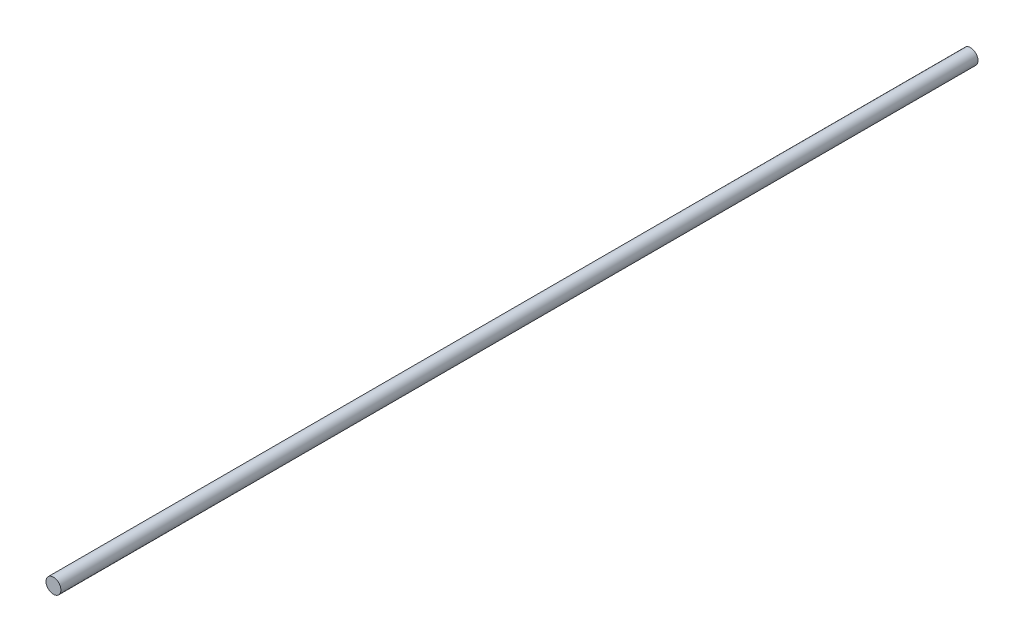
from build123d import *

# Parameters (mm, degrees)
SKIZZE1_R                       = 5
AUFSATZ_LINEAR_AUSTRAGEN1_DEPTH = 615


with BuildPart() as part:
    # Skizze1 → Aufsatz-Linear austragen1 (new body)
    with BuildSketch(Plane.XY):
        Circle(SKIZZE1_R)
    extrude(amount=AUFSATZ_LINEAR_AUSTRAGEN1_DEPTH)


solid = part.part
